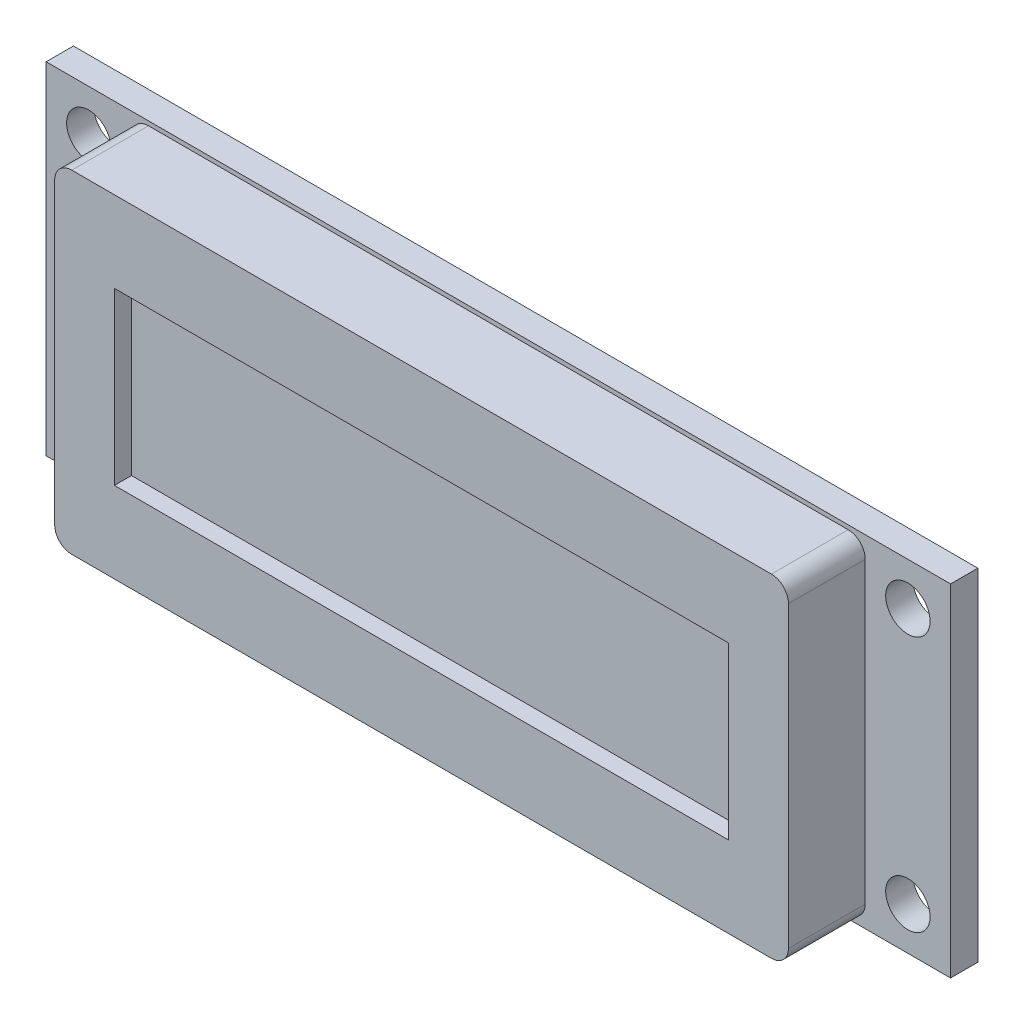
from build123d import *

# Parameters (mm, degrees)
ESQUISSE1_W        = 53
ESQUISSE1_H        = 20
ESQUISSE1_R        = 1.3
BOSS_EXTRU_1_DEPTH = 1.6
ESQUISSE1_3_W      = 36
ESQUISSE1_3_H      = 10
BOSS_EXTRU_3_DEPTH = 4.5
ESQUISSE2_W        = 36
ESQUISSE2_H        = 10
BOSS_EXTRU_4_DEPTH = 1


with BuildPart() as part:
    # Esquisse1 → Boss.-Extru.1 (new body)
    with BuildSketch(Plane.XY):
        Rectangle(ESQUISSE1_W, ESQUISSE1_H)
        with Locations((-24, 7.5)):
            Circle(ESQUISSE1_R, mode=Mode.SUBTRACT)
        with Locations((-24, -7.5)):
            Circle(ESQUISSE1_R, mode=Mode.SUBTRACT)
        with Locations((24, 7.5)):
            Circle(ESQUISSE1_R, mode=Mode.SUBTRACT)
        with Locations((24, -7.5)):
            Circle(ESQUISSE1_R, mode=Mode.SUBTRACT)
    extrude(amount=-BOSS_EXTRU_1_DEPTH)

    # Esquisse1_3 → Boss.-Extru.3 (add)
    with BuildSketch(Plane.XY):
        with BuildLine():
            Line((-21.5, 8.75), (-21.5, -8.75))
            ThreePointArc((-21.5, -8.75), (-21.207106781, -9.457106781), (-20.5, -9.75))
            Line((-20.5, -9.75), (20.5, -9.75))
            ThreePointArc((20.5, -9.75), (21.207106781, -9.457106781), (21.5, -8.75))
            Line((21.5, -8.75), (21.5, 8.75))
            ThreePointArc((21.5, 8.75), (21.207106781, 9.457106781), (20.5, 9.75))
            Line((20.5, 9.75), (-20.5, 9.75))
            ThreePointArc((-20.5, 9.75), (-21.207106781, 9.457106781), (-21.5, 8.75))
        make_face()
        Rectangle(ESQUISSE1_3_W, ESQUISSE1_3_H, mode=Mode.SUBTRACT)
    extrude(amount=BOSS_EXTRU_3_DEPTH)

    # Esquisse2 → Boss.-Extru.4 (add)
    with BuildSketch(Plane.XY.offset(3.5)):
        Rectangle(ESQUISSE2_W, ESQUISSE2_H)
    extrude(amount=-BOSS_EXTRU_4_DEPTH)


solid = part.part
